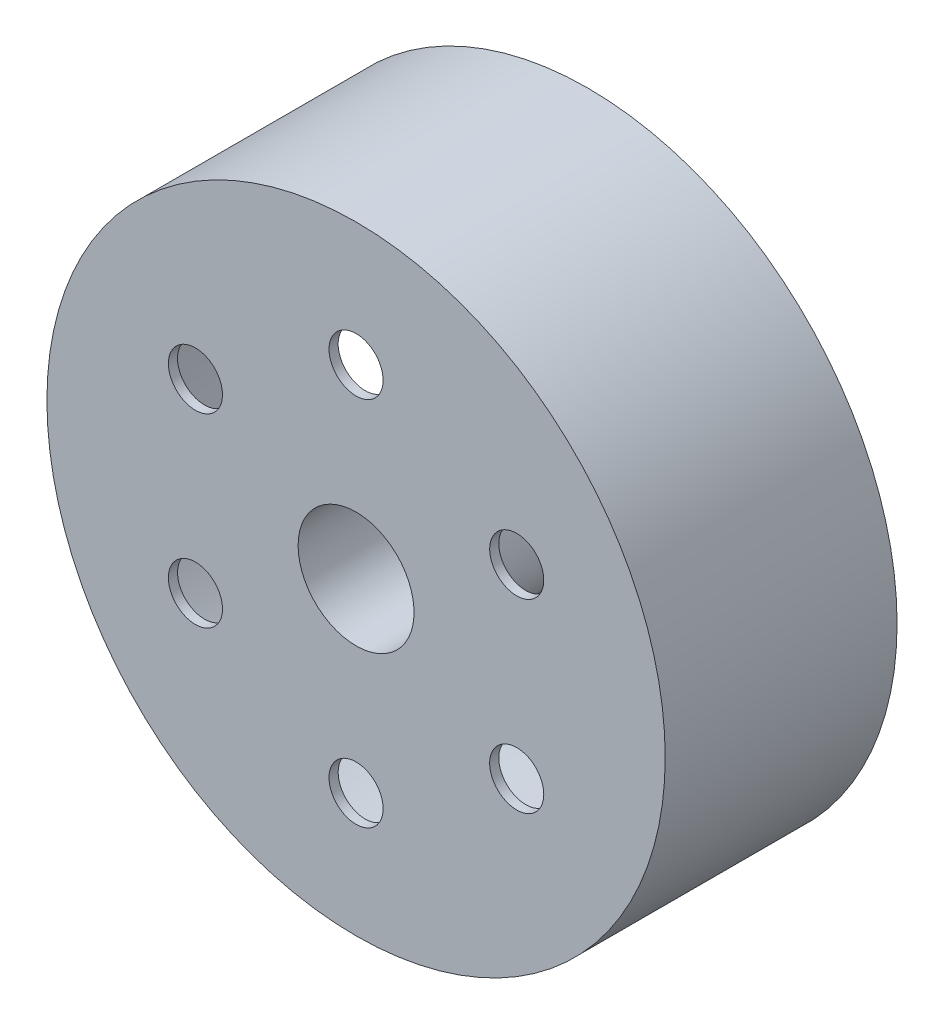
ISO-10303-21;
HEADER;
FILE_DESCRIPTION(('STEP AP214'),'2;1');
FILE_NAME('part.step','',(''),(''),'','','');
FILE_SCHEMA(('AUTOMOTIVE_DESIGN { 1 0 10303 214 1 1 1 1 }'));
ENDSEC;
DATA;
#1=APPLICATION_CONTEXT('core data for automotive mechanical design processes');
#2=APPLICATION_PROTOCOL_DEFINITION('international standard','automotive_design',2000,#1);
#3=PRODUCT_CONTEXT('',#1,'mechanical');
#4=PRODUCT('Part','Part','',(#3));
#5=PRODUCT_RELATED_PRODUCT_CATEGORY('part','',(#4));
#6=PRODUCT_DEFINITION_FORMATION('','',#4);
#7=PRODUCT_DEFINITION_CONTEXT('part definition',#1,'design');
#8=PRODUCT_DEFINITION('design','',#6,#7);
#9=PRODUCT_DEFINITION_SHAPE('','',#8);
#10=(LENGTH_UNIT() NAMED_UNIT(*) SI_UNIT(.MILLI.,.METRE.));
#11=(NAMED_UNIT(*) PLANE_ANGLE_UNIT() SI_UNIT($,.RADIAN.));
#12=(NAMED_UNIT(*) SI_UNIT($,.STERADIAN.) SOLID_ANGLE_UNIT());
#13=UNCERTAINTY_MEASURE_WITH_UNIT(LENGTH_MEASURE(1.E-05),#10,'distance_accuracy_value','');
#14=(GEOMETRIC_REPRESENTATION_CONTEXT(3) GLOBAL_UNCERTAINTY_ASSIGNED_CONTEXT((#13)) GLOBAL_UNIT_ASSIGNED_CONTEXT((#10,
#11,#12)) REPRESENTATION_CONTEXT('',''));
#15=CARTESIAN_POINT('',(0.,0.,0.));
#16=DIRECTION('',(0.,0.,1.));
#17=DIRECTION('',(1.,0.,0.));
#18=AXIS2_PLACEMENT_3D('',#15,#16,#17);
#19=CARTESIAN_POINT('',(0.,0.,0.));
#20=DIRECTION('',(0.,0.,1.));
#21=DIRECTION('',(1.,0.,0.));
#22=AXIS2_PLACEMENT_3D('',#19,#20,#21);
#23=PLANE('',#22);
#24=CARTESIAN_POINT('',(0.,0.,0.));
#25=DIRECTION('',(0.,0.,1.));
#26=DIRECTION('',(1.,0.,0.));
#27=AXIS2_PLACEMENT_3D('',#24,#25,#26);
#28=CIRCLE('',#27,19.05);
#29=CARTESIAN_POINT('',(-19.05,0.,0.));
#30=VERTEX_POINT('',#29);
#31=EDGE_CURVE('E55',#30,#30,#28,.T.);
#32=ORIENTED_EDGE('',*,*,#31,.T.);
#33=EDGE_LOOP('',(#32));
#34=FACE_BOUND('',#33,.T.);
#35=CARTESIAN_POINT('',(0.,0.,0.));
#36=DIRECTION('',(0.,0.,-1.));
#37=DIRECTION('',(-1.,0.,0.));
#38=AXIS2_PLACEMENT_3D('',#35,#36,#37);
#39=CIRCLE('',#38,24.13);
#40=CARTESIAN_POINT('',(-24.13,0.,0.));
#41=VERTEX_POINT('',#40);
#42=EDGE_CURVE('E67',#41,#41,#39,.T.);
#43=ORIENTED_EDGE('',*,*,#42,.T.);
#44=EDGE_LOOP('',(#43));
#45=FACE_BOUND('',#44,.T.);
#46=ADVANCED_FACE('F38',(#34,#45),#23,.F.);
#47=CARTESIAN_POINT('',(0.,0.,76.2));
#48=DIRECTION('',(0.,0.,1.));
#49=DIRECTION('',(1.,0.,0.));
#50=AXIS2_PLACEMENT_3D('',#47,#48,#49);
#51=PLANE('',#50);
#52=CARTESIAN_POINT('',(52.792908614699,30.4800000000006,76.2));
#53=DIRECTION('',(0.,0.,1.));
#54=DIRECTION('',(0.50000000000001,-0.866025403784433,0.));
#55=AXIS2_PLACEMENT_3D('',#52,#53,#54);
#56=CIRCLE('',#55,8.89);
#57=CARTESIAN_POINT('',(57.2379086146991,22.781034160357,76.2));
#58=VERTEX_POINT('',#57);
#59=EDGE_CURVE('E96',#58,#58,#56,.T.);
#60=ORIENTED_EDGE('',*,*,#59,.F.);
#61=EDGE_LOOP('',(#60));
#62=FACE_BOUND('',#61,.T.);
#63=CARTESIAN_POINT('',(52.7929086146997,-30.4799999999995,76.2));
#64=DIRECTION('',(0.,0.,1.));
#65=DIRECTION('',(-0.499999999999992,-0.866025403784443,0.));
#66=AXIS2_PLACEMENT_3D('',#63,#64,#65);
#67=CIRCLE('',#66,8.89);
#68=CARTESIAN_POINT('',(48.3479086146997,-38.1789658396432,76.2));
#69=VERTEX_POINT('',#68);
#70=EDGE_CURVE('E95',#69,#69,#67,.T.);
#71=ORIENTED_EDGE('',*,*,#70,.F.);
#72=EDGE_LOOP('',(#71));
#73=FACE_BOUND('',#72,.T.);
#74=CARTESIAN_POINT('',(0.,-60.96,76.2));
#75=DIRECTION('',(0.,0.,1.));
#76=DIRECTION('',(-1.,0.,0.));
#77=AXIS2_PLACEMENT_3D('',#74,#75,#76);
#78=CIRCLE('',#77,8.89);
#79=CARTESIAN_POINT('',(-8.89,-60.96,76.2));
#80=VERTEX_POINT('',#79);
#81=EDGE_CURVE('E104',#80,#80,#78,.T.);
#82=ORIENTED_EDGE('',*,*,#81,.F.);
#83=EDGE_LOOP('',(#82));
#84=FACE_BOUND('',#83,.T.);
#85=CARTESIAN_POINT('',(-52.7929086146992,-30.4800000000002,76.2));
#86=DIRECTION('',(0.,0.,1.));
#87=DIRECTION('',(-0.500000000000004,0.866025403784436,0.));
#88=AXIS2_PLACEMENT_3D('',#85,#86,#87);
#89=CIRCLE('',#88,8.89);
#90=CARTESIAN_POINT('',(-57.2379086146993,-22.7810341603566,76.2));
#91=VERTEX_POINT('',#90);
#92=EDGE_CURVE('E112',#91,#91,#89,.T.);
#93=ORIENTED_EDGE('',*,*,#92,.F.);
#94=EDGE_LOOP('',(#93));
#95=FACE_BOUND('',#94,.T.);
#96=CARTESIAN_POINT('',(-52.7929086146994,30.4799999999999,76.2));
#97=DIRECTION('',(0.,0.,1.));
#98=DIRECTION('',(0.499999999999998,0.86602540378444,0.));
#99=AXIS2_PLACEMENT_3D('',#96,#97,#98);
#100=CIRCLE('',#99,8.89);
#101=CARTESIAN_POINT('',(-48.3479086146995,38.1789658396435,76.2));
#102=VERTEX_POINT('',#101);
#103=EDGE_CURVE('E86',#102,#102,#100,.T.);
#104=ORIENTED_EDGE('',*,*,#103,.F.);
#105=EDGE_LOOP('',(#104));
#106=FACE_BOUND('',#105,.T.);
#107=CARTESIAN_POINT('',(0.,60.96,76.2));
#108=DIRECTION('',(0.,0.,1.));
#109=DIRECTION('',(1.,0.,0.));
#110=AXIS2_PLACEMENT_3D('',#107,#108,#109);
#111=CIRCLE('',#110,8.89);
#112=CARTESIAN_POINT('',(8.89,60.96,76.2));
#113=VERTEX_POINT('',#112);
#114=EDGE_CURVE('E78',#113,#113,#111,.T.);
#115=ORIENTED_EDGE('',*,*,#114,.F.);
#116=EDGE_LOOP('',(#115));
#117=FACE_BOUND('',#116,.T.);
#118=CARTESIAN_POINT('',(0.,0.,76.2));
#119=DIRECTION('',(0.,0.,1.));
#120=DIRECTION('',(1.,0.,0.));
#121=AXIS2_PLACEMENT_3D('',#118,#119,#120);
#122=CIRCLE('',#121,101.6);
#123=CARTESIAN_POINT('',(-101.6,0.,76.2));
#124=VERTEX_POINT('',#123);
#125=EDGE_CURVE('E11',#124,#124,#122,.T.);
#126=ORIENTED_EDGE('',*,*,#125,.T.);
#127=EDGE_LOOP('',(#126));
#128=FACE_BOUND('',#127,.T.);
#129=CARTESIAN_POINT('',(0.,0.,76.2));
#130=DIRECTION('',(0.,0.,1.));
#131=DIRECTION('',(1.,0.,0.));
#132=AXIS2_PLACEMENT_3D('',#129,#130,#131);
#133=CIRCLE('',#132,19.05);
#134=CARTESIAN_POINT('',(-19.05,0.,76.2));
#135=VERTEX_POINT('',#134);
#136=EDGE_CURVE('E53',#135,#135,#133,.T.);
#137=ORIENTED_EDGE('',*,*,#136,.F.);
#138=EDGE_LOOP('',(#137));
#139=FACE_BOUND('',#138,.T.);
#140=ADVANCED_FACE('F126',(#62,#73,#84,#95,#106,#117,#128,#139),#51,.T.);
#141=CARTESIAN_POINT('',(0.,0.,0.));
#142=DIRECTION('',(0.,0.,-1.));
#143=DIRECTION('',(-1.,0.,0.));
#144=AXIS2_PLACEMENT_3D('',#141,#142,#143);
#145=CIRCLE('',#144,96.52);
#146=CARTESIAN_POINT('',(-96.52,0.,0.));
#147=VERTEX_POINT('',#146);
#148=EDGE_CURVE('E71',#147,#147,#145,.T.);
#149=ORIENTED_EDGE('',*,*,#148,.F.);
#150=EDGE_LOOP('',(#149));
#151=FACE_BOUND('',#150,.T.);
#152=CARTESIAN_POINT('',(0.,0.,0.));
#153=DIRECTION('',(0.,0.,1.));
#154=DIRECTION('',(1.,0.,0.));
#155=AXIS2_PLACEMENT_3D('',#152,#153,#154);
#156=CIRCLE('',#155,101.6);
#157=CARTESIAN_POINT('',(-101.6,0.,0.));
#158=VERTEX_POINT('',#157);
#159=EDGE_CURVE('E47',#158,#158,#156,.T.);
#160=ORIENTED_EDGE('',*,*,#159,.F.);
#161=EDGE_LOOP('',(#160));
#162=FACE_BOUND('',#161,.T.);
#163=ADVANCED_FACE('F129',(#151,#162),#23,.F.);
#164=CARTESIAN_POINT('',(0.,0.,76.2));
#165=DIRECTION('',(0.,0.,-1.));
#166=DIRECTION('',(-1.,0.,0.));
#167=AXIS2_PLACEMENT_3D('',#164,#165,#166);
#168=CYLINDRICAL_SURFACE('',#167,101.6);
#169=CARTESIAN_POINT('',(-101.6,0.,76.2));
#170=CARTESIAN_POINT('',(-101.6,0.,75.40625));
#171=CARTESIAN_POINT('',(-101.6,0.,74.6125));
#172=CARTESIAN_POINT('',(-101.6,0.,73.025));
#173=CARTESIAN_POINT('',(-101.6,0.,72.23125));
#174=CARTESIAN_POINT('',(-101.6,0.,70.64375));
#175=CARTESIAN_POINT('',(-101.6,0.,69.85));
#176=CARTESIAN_POINT('',(-101.6,0.,68.2625));
#177=CARTESIAN_POINT('',(-101.6,0.,67.46875));
#178=CARTESIAN_POINT('',(-101.6,0.,65.88125));
#179=CARTESIAN_POINT('',(-101.6,0.,65.0875));
#180=CARTESIAN_POINT('',(-101.6,0.,63.5));
#181=CARTESIAN_POINT('',(-101.6,0.,62.70625));
#182=CARTESIAN_POINT('',(-101.6,0.,61.11875));
#183=CARTESIAN_POINT('',(-101.6,0.,60.325));
#184=CARTESIAN_POINT('',(-101.6,0.,58.7375));
#185=CARTESIAN_POINT('',(-101.6,0.,57.94375));
#186=CARTESIAN_POINT('',(-101.6,0.,56.35625));
#187=CARTESIAN_POINT('',(-101.6,0.,55.5625));
#188=CARTESIAN_POINT('',(-101.6,0.,53.975));
#189=CARTESIAN_POINT('',(-101.6,0.,53.18125));
#190=CARTESIAN_POINT('',(-101.6,0.,51.59375));
#191=CARTESIAN_POINT('',(-101.6,0.,50.8));
#192=CARTESIAN_POINT('',(-101.6,0.,49.2125));
#193=CARTESIAN_POINT('',(-101.6,0.,48.41875));
#194=CARTESIAN_POINT('',(-101.6,0.,46.83125));
#195=CARTESIAN_POINT('',(-101.6,0.,46.0375));
#196=CARTESIAN_POINT('',(-101.6,0.,44.45));
#197=CARTESIAN_POINT('',(-101.6,0.,43.65625));
#198=CARTESIAN_POINT('',(-101.6,0.,42.06875));
#199=CARTESIAN_POINT('',(-101.6,0.,41.275));
#200=CARTESIAN_POINT('',(-101.6,0.,39.6875));
#201=CARTESIAN_POINT('',(-101.6,0.,38.89375));
#202=CARTESIAN_POINT('',(-101.6,0.,37.30625));
#203=CARTESIAN_POINT('',(-101.6,0.,36.5125));
#204=CARTESIAN_POINT('',(-101.6,0.,34.925));
#205=CARTESIAN_POINT('',(-101.6,0.,34.13125));
#206=CARTESIAN_POINT('',(-101.6,0.,32.54375));
#207=CARTESIAN_POINT('',(-101.6,0.,31.75));
#208=CARTESIAN_POINT('',(-101.6,0.,30.1625));
#209=CARTESIAN_POINT('',(-101.6,0.,29.36875));
#210=CARTESIAN_POINT('',(-101.6,0.,27.78125));
#211=CARTESIAN_POINT('',(-101.6,0.,26.9875));
#212=CARTESIAN_POINT('',(-101.6,0.,25.4));
#213=CARTESIAN_POINT('',(-101.6,0.,24.60625));
#214=CARTESIAN_POINT('',(-101.6,0.,23.01875));
#215=CARTESIAN_POINT('',(-101.6,0.,22.225));
#216=CARTESIAN_POINT('',(-101.6,0.,20.6375));
#217=CARTESIAN_POINT('',(-101.6,0.,19.84375));
#218=CARTESIAN_POINT('',(-101.6,0.,18.25625));
#219=CARTESIAN_POINT('',(-101.6,0.,17.4625));
#220=CARTESIAN_POINT('',(-101.6,0.,15.875));
#221=CARTESIAN_POINT('',(-101.6,0.,15.08125));
#222=CARTESIAN_POINT('',(-101.6,0.,13.49375));
#223=CARTESIAN_POINT('',(-101.6,0.,12.7));
#224=CARTESIAN_POINT('',(-101.6,0.,11.1125));
#225=CARTESIAN_POINT('',(-101.6,0.,10.31875));
#226=CARTESIAN_POINT('',(-101.6,0.,8.73125));
#227=CARTESIAN_POINT('',(-101.6,0.,7.93750000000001));
#228=CARTESIAN_POINT('',(-101.6,0.,6.35));
#229=CARTESIAN_POINT('',(-101.6,0.,5.55625));
#230=CARTESIAN_POINT('',(-101.6,0.,3.96875));
#231=CARTESIAN_POINT('',(-101.6,0.,3.175));
#232=CARTESIAN_POINT('',(-101.6,0.,1.5875));
#233=CARTESIAN_POINT('',(-101.6,0.,0.793750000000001));
#234=CARTESIAN_POINT('',(-101.6,0.,0.));
#235=B_SPLINE_CURVE_WITH_KNOTS('',3,(#169,#170,#171,#172,#173,#174,#175,#176,#177,#178,#179,
#180,#181,#182,#183,#184,#185,#186,#187,#188,#189,#190,#191,#192,#193,#194,#195,#196,#197,#198,
#199,#200,#201,#202,#203,#204,#205,#206,#207,#208,#209,#210,#211,#212,#213,#214,#215,#216,#217,
#218,#219,#220,#221,#222,#223,#224,#225,#226,#227,#228,#229,#230,#231,#232,#233,#234),
.UNSPECIFIED.,.F.,.F.,(4,2,2,2,2,2,2,2,2,2,2,2,2,2,2,2,2,2,2,2,2,2,2,2,2,2,2,2,2,2,2,2,4),(0.,
2.38125,4.7625,7.14375,9.52500000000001,11.90625,14.2875,16.66875,19.05,21.43125,23.8125,
26.19375,28.575,30.95625,33.3375,35.71875,38.1,40.48125,42.8625,45.24375,47.625,50.00625,
52.3875,54.76875,57.15,59.53125,61.9125,64.29375,66.675,69.05625,71.4375,73.81875,76.2),.UNSPECIFIED.);
#236=EDGE_CURVE('BSEAM40',#124,#158,#235,.T.);
#237=ORIENTED_EDGE('',*,*,#125,.F.);
#238=ORIENTED_EDGE('',*,*,#159,.T.);
#239=ORIENTED_EDGE('',*,*,#236,.T.);
#240=ORIENTED_EDGE('',*,*,#236,.F.);
#241=EDGE_LOOP('',(#237,#239,#238,#240));
#242=FACE_BOUND('',#241,.T.);
#243=ADVANCED_FACE('F40',(#242),#168,.T.);
#244=CARTESIAN_POINT('',(0.,0.,76.2));
#245=DIRECTION('',(0.,0.,-1.));
#246=DIRECTION('',(-1.,0.,0.));
#247=AXIS2_PLACEMENT_3D('',#244,#245,#246);
#248=CYLINDRICAL_SURFACE('',#247,19.05);
#249=CARTESIAN_POINT('',(-19.05,0.,76.2));
#250=CARTESIAN_POINT('',(-19.05,0.,75.40625));
#251=CARTESIAN_POINT('',(-19.05,0.,74.6125));
#252=CARTESIAN_POINT('',(-19.05,0.,73.025));
#253=CARTESIAN_POINT('',(-19.05,0.,72.23125));
#254=CARTESIAN_POINT('',(-19.05,0.,70.64375));
#255=CARTESIAN_POINT('',(-19.05,0.,69.85));
#256=CARTESIAN_POINT('',(-19.05,0.,68.2625));
#257=CARTESIAN_POINT('',(-19.05,0.,67.46875));
#258=CARTESIAN_POINT('',(-19.05,0.,65.88125));
#259=CARTESIAN_POINT('',(-19.05,0.,65.0875));
#260=CARTESIAN_POINT('',(-19.05,0.,63.5));
#261=CARTESIAN_POINT('',(-19.05,0.,62.70625));
#262=CARTESIAN_POINT('',(-19.05,0.,61.11875));
#263=CARTESIAN_POINT('',(-19.05,0.,60.325));
#264=CARTESIAN_POINT('',(-19.05,0.,58.7375));
#265=CARTESIAN_POINT('',(-19.05,0.,57.94375));
#266=CARTESIAN_POINT('',(-19.05,0.,56.35625));
#267=CARTESIAN_POINT('',(-19.05,0.,55.5625));
#268=CARTESIAN_POINT('',(-19.05,0.,53.975));
#269=CARTESIAN_POINT('',(-19.05,0.,53.18125));
#270=CARTESIAN_POINT('',(-19.05,0.,51.59375));
#271=CARTESIAN_POINT('',(-19.05,0.,50.8));
#272=CARTESIAN_POINT('',(-19.05,0.,49.2125));
#273=CARTESIAN_POINT('',(-19.05,0.,48.41875));
#274=CARTESIAN_POINT('',(-19.05,0.,46.83125));
#275=CARTESIAN_POINT('',(-19.05,0.,46.0375));
#276=CARTESIAN_POINT('',(-19.05,0.,44.45));
#277=CARTESIAN_POINT('',(-19.05,0.,43.65625));
#278=CARTESIAN_POINT('',(-19.05,0.,42.06875));
#279=CARTESIAN_POINT('',(-19.05,0.,41.275));
#280=CARTESIAN_POINT('',(-19.05,0.,39.6875));
#281=CARTESIAN_POINT('',(-19.05,0.,38.89375));
#282=CARTESIAN_POINT('',(-19.05,0.,37.30625));
#283=CARTESIAN_POINT('',(-19.05,0.,36.5125));
#284=CARTESIAN_POINT('',(-19.05,0.,34.925));
#285=CARTESIAN_POINT('',(-19.05,0.,34.13125));
#286=CARTESIAN_POINT('',(-19.05,0.,32.54375));
#287=CARTESIAN_POINT('',(-19.05,0.,31.75));
#288=CARTESIAN_POINT('',(-19.05,0.,30.1625));
#289=CARTESIAN_POINT('',(-19.05,0.,29.36875));
#290=CARTESIAN_POINT('',(-19.05,0.,27.78125));
#291=CARTESIAN_POINT('',(-19.05,0.,26.9875));
#292=CARTESIAN_POINT('',(-19.05,0.,25.4));
#293=CARTESIAN_POINT('',(-19.05,0.,24.60625));
#294=CARTESIAN_POINT('',(-19.05,0.,23.01875));
#295=CARTESIAN_POINT('',(-19.05,0.,22.225));
#296=CARTESIAN_POINT('',(-19.05,0.,20.6375));
#297=CARTESIAN_POINT('',(-19.05,0.,19.84375));
#298=CARTESIAN_POINT('',(-19.05,0.,18.25625));
#299=CARTESIAN_POINT('',(-19.05,0.,17.4625));
#300=CARTESIAN_POINT('',(-19.05,0.,15.875));
#301=CARTESIAN_POINT('',(-19.05,0.,15.08125));
#302=CARTESIAN_POINT('',(-19.05,0.,13.49375));
#303=CARTESIAN_POINT('',(-19.05,0.,12.7));
#304=CARTESIAN_POINT('',(-19.05,0.,11.1125));
#305=CARTESIAN_POINT('',(-19.05,0.,10.31875));
#306=CARTESIAN_POINT('',(-19.05,0.,8.73125));
#307=CARTESIAN_POINT('',(-19.05,0.,7.93750000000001));
#308=CARTESIAN_POINT('',(-19.05,0.,6.35));
#309=CARTESIAN_POINT('',(-19.05,0.,5.55625));
#310=CARTESIAN_POINT('',(-19.05,0.,3.96875));
#311=CARTESIAN_POINT('',(-19.05,0.,3.175));
#312=CARTESIAN_POINT('',(-19.05,0.,1.5875));
#313=CARTESIAN_POINT('',(-19.05,0.,0.793750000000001));
#314=CARTESIAN_POINT('',(-19.05,0.,0.));
#315=B_SPLINE_CURVE_WITH_KNOTS('',3,(#249,#250,#251,#252,#253,#254,#255,#256,#257,#258,#259,
#260,#261,#262,#263,#264,#265,#266,#267,#268,#269,#270,#271,#272,#273,#274,#275,#276,#277,#278,
#279,#280,#281,#282,#283,#284,#285,#286,#287,#288,#289,#290,#291,#292,#293,#294,#295,#296,#297,
#298,#299,#300,#301,#302,#303,#304,#305,#306,#307,#308,#309,#310,#311,#312,#313,#314),
.UNSPECIFIED.,.F.,.F.,(4,2,2,2,2,2,2,2,2,2,2,2,2,2,2,2,2,2,2,2,2,2,2,2,2,2,2,2,2,2,2,2,4),(0.,
2.38125,4.7625,7.14375,9.52500000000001,11.90625,14.2875,16.66875,19.05,21.43125,23.8125,
26.19375,28.575,30.95625,33.3375,35.71875,38.1,40.48125,42.8625,45.24375,47.625,50.00625,
52.3875,54.76875,57.15,59.53125,61.9125,64.29375,66.675,69.05625,71.4375,73.81875,76.2),.UNSPECIFIED.);
#316=EDGE_CURVE('BSEAM138',#135,#30,#315,.T.);
#317=ORIENTED_EDGE('',*,*,#136,.T.);
#318=ORIENTED_EDGE('',*,*,#31,.F.);
#319=ORIENTED_EDGE('',*,*,#316,.T.);
#320=ORIENTED_EDGE('',*,*,#316,.F.);
#321=EDGE_LOOP('',(#317,#319,#318,#320));
#322=FACE_BOUND('',#321,.T.);
#323=ADVANCED_FACE('F138',(#322),#248,.F.);
#324=CARTESIAN_POINT('',(0.,0.,349.199786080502));
#325=DIRECTION('',(0.,0.,-1.));
#326=DIRECTION('',(-1.,0.,0.));
#327=AXIS2_PLACEMENT_3D('',#324,#325,#326);
#328=CYLINDRICAL_SURFACE('',#327,96.52);
#329=CARTESIAN_POINT('',(0.,0.,73.2));
#330=DIRECTION('',(0.,0.,1.));
#331=DIRECTION('',(1.,0.,0.));
#332=AXIS2_PLACEMENT_3D('',#329,#330,#331);
#333=CIRCLE('',#332,96.52);
#334=CARTESIAN_POINT('',(-96.52,0.,73.1999999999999));
#335=VERTEX_POINT('',#334);
#336=EDGE_CURVE('E63',#335,#335,#333,.F.);
#337=CARTESIAN_POINT('',(-96.52,0.,0.));
#338=CARTESIAN_POINT('',(-96.52,0.,0.762499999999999));
#339=CARTESIAN_POINT('',(-96.52,0.,1.525));
#340=CARTESIAN_POINT('',(-96.52,0.,3.05));
#341=CARTESIAN_POINT('',(-96.52,0.,3.8125));
#342=CARTESIAN_POINT('',(-96.52,0.,5.3375));
#343=CARTESIAN_POINT('',(-96.52,0.,6.09999999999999));
#344=CARTESIAN_POINT('',(-96.52,0.,7.62499999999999));
#345=CARTESIAN_POINT('',(-96.52,0.,8.38749999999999));
#346=CARTESIAN_POINT('',(-96.52,0.,9.91249999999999));
#347=CARTESIAN_POINT('',(-96.52,0.,10.675));
#348=CARTESIAN_POINT('',(-96.52,0.,12.2));
#349=CARTESIAN_POINT('',(-96.52,0.,12.9625));
#350=CARTESIAN_POINT('',(-96.52,0.,14.4875));
#351=CARTESIAN_POINT('',(-96.52,0.,15.25));
#352=CARTESIAN_POINT('',(-96.52,0.,16.775));
#353=CARTESIAN_POINT('',(-96.52,0.,17.5375));
#354=CARTESIAN_POINT('',(-96.52,0.,19.0625));
#355=CARTESIAN_POINT('',(-96.52,0.,19.825));
#356=CARTESIAN_POINT('',(-96.52,0.,21.35));
#357=CARTESIAN_POINT('',(-96.52,0.,22.1125));
#358=CARTESIAN_POINT('',(-96.52,0.,23.6375));
#359=CARTESIAN_POINT('',(-96.52,0.,24.4));
#360=CARTESIAN_POINT('',(-96.52,0.,25.925));
#361=CARTESIAN_POINT('',(-96.52,0.,26.6875));
#362=CARTESIAN_POINT('',(-96.52,0.,28.2125));
#363=CARTESIAN_POINT('',(-96.52,0.,28.975));
#364=CARTESIAN_POINT('',(-96.52,0.,30.5));
#365=CARTESIAN_POINT('',(-96.52,0.,31.2625));
#366=CARTESIAN_POINT('',(-96.52,0.,32.7875));
#367=CARTESIAN_POINT('',(-96.52,0.,33.55));
#368=CARTESIAN_POINT('',(-96.52,0.,35.075));
#369=CARTESIAN_POINT('',(-96.52,0.,35.8375));
#370=CARTESIAN_POINT('',(-96.52,0.,37.3625));
#371=CARTESIAN_POINT('',(-96.52,0.,38.125));
#372=CARTESIAN_POINT('',(-96.52,0.,39.65));
#373=CARTESIAN_POINT('',(-96.52,0.,40.4125));
#374=CARTESIAN_POINT('',(-96.52,0.,41.9375));
#375=CARTESIAN_POINT('',(-96.52,0.,42.7));
#376=CARTESIAN_POINT('',(-96.52,0.,44.225));
#377=CARTESIAN_POINT('',(-96.52,0.,44.9875));
#378=CARTESIAN_POINT('',(-96.52,0.,46.5125));
#379=CARTESIAN_POINT('',(-96.52,0.,47.275));
#380=CARTESIAN_POINT('',(-96.52,0.,48.8));
#381=CARTESIAN_POINT('',(-96.52,0.,49.5625));
#382=CARTESIAN_POINT('',(-96.52,0.,51.0874999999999));
#383=CARTESIAN_POINT('',(-96.52,0.,51.85));
#384=CARTESIAN_POINT('',(-96.52,0.,53.375));
#385=CARTESIAN_POINT('',(-96.52,0.,54.1374999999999));
#386=CARTESIAN_POINT('',(-96.52,0.,55.6625));
#387=CARTESIAN_POINT('',(-96.52,0.,56.4249999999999));
#388=CARTESIAN_POINT('',(-96.52,0.,57.9499999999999));
#389=CARTESIAN_POINT('',(-96.52,0.,58.7124999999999));
#390=CARTESIAN_POINT('',(-96.52,0.,60.2374999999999));
#391=CARTESIAN_POINT('',(-96.52,0.,60.9999999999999));
#392=CARTESIAN_POINT('',(-96.52,0.,62.5249999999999));
#393=CARTESIAN_POINT('',(-96.52,0.,63.2874999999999));
#394=CARTESIAN_POINT('',(-96.52,0.,64.8124999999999));
#395=CARTESIAN_POINT('',(-96.52,0.,65.5749999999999));
#396=CARTESIAN_POINT('',(-96.52,0.,67.0999999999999));
#397=CARTESIAN_POINT('',(-96.52,0.,67.8624999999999));
#398=CARTESIAN_POINT('',(-96.52,0.,69.3874999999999));
#399=CARTESIAN_POINT('',(-96.52,0.,70.1499999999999));
#400=CARTESIAN_POINT('',(-96.52,0.,71.6749999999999));
#401=CARTESIAN_POINT('',(-96.52,0.,72.4374999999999));
#402=CARTESIAN_POINT('',(-96.52,0.,73.1999999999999));
#403=B_SPLINE_CURVE_WITH_KNOTS('',3,(#337,#338,#339,#340,#341,#342,#343,#344,#345,#346,#347,
#348,#349,#350,#351,#352,#353,#354,#355,#356,#357,#358,#359,#360,#361,#362,#363,#364,#365,#366,
#367,#368,#369,#370,#371,#372,#373,#374,#375,#376,#377,#378,#379,#380,#381,#382,#383,#384,#385,
#386,#387,#388,#389,#390,#391,#392,#393,#394,#395,#396,#397,#398,#399,#400,#401,#402),
.UNSPECIFIED.,.F.,.F.,(4,2,2,2,2,2,2,2,2,2,2,2,2,2,2,2,2,2,2,2,2,2,2,2,2,2,2,2,2,2,2,2,4),(0.,
2.2875,4.575,6.86249999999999,9.14999999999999,11.4375,13.725,16.0125,18.3,20.5875,22.875,
25.1625,27.45,29.7375,32.025,34.3125,36.6,38.8875,41.175,43.4625,45.75,48.0375,50.325,52.6125,
54.8999999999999,57.1874999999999,59.4749999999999,61.7624999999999,64.0499999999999,
66.3374999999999,68.6249999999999,70.9124999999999,73.1999999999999),.UNSPECIFIED.);
#404=EDGE_CURVE('BSEAM141',#147,#335,#403,.T.);
#405=ORIENTED_EDGE('',*,*,#148,.T.);
#406=ORIENTED_EDGE('',*,*,#336,.F.);
#407=ORIENTED_EDGE('',*,*,#404,.T.);
#408=ORIENTED_EDGE('',*,*,#404,.F.);
#409=EDGE_LOOP('',(#405,#407,#406,#408));
#410=FACE_BOUND('',#409,.T.);
#411=ADVANCED_FACE('F141',(#410),#328,.F.);
#412=CARTESIAN_POINT('',(0.,0.,349.199786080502));
#413=DIRECTION('',(0.,0.,-1.));
#414=DIRECTION('',(-1.,0.,0.));
#415=AXIS2_PLACEMENT_3D('',#412,#413,#414);
#416=CYLINDRICAL_SURFACE('',#415,24.13);
#417=CARTESIAN_POINT('',(0.,0.,73.2));
#418=DIRECTION('',(0.,0.,1.));
#419=DIRECTION('',(1.,0.,0.));
#420=AXIS2_PLACEMENT_3D('',#417,#418,#419);
#421=CIRCLE('',#420,24.13);
#422=CARTESIAN_POINT('',(-24.13,0.,73.1999999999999));
#423=VERTEX_POINT('',#422);
#424=EDGE_CURVE('E59',#423,#423,#421,.F.);
#425=CARTESIAN_POINT('',(-24.13,0.,0.));
#426=CARTESIAN_POINT('',(-24.13,0.,0.762499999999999));
#427=CARTESIAN_POINT('',(-24.13,0.,1.525));
#428=CARTESIAN_POINT('',(-24.13,0.,3.05));
#429=CARTESIAN_POINT('',(-24.13,0.,3.8125));
#430=CARTESIAN_POINT('',(-24.13,0.,5.3375));
#431=CARTESIAN_POINT('',(-24.13,0.,6.09999999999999));
#432=CARTESIAN_POINT('',(-24.13,0.,7.62499999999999));
#433=CARTESIAN_POINT('',(-24.13,0.,8.38749999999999));
#434=CARTESIAN_POINT('',(-24.13,0.,9.91249999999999));
#435=CARTESIAN_POINT('',(-24.13,0.,10.675));
#436=CARTESIAN_POINT('',(-24.13,0.,12.2));
#437=CARTESIAN_POINT('',(-24.13,0.,12.9625));
#438=CARTESIAN_POINT('',(-24.13,0.,14.4875));
#439=CARTESIAN_POINT('',(-24.13,0.,15.25));
#440=CARTESIAN_POINT('',(-24.13,0.,16.775));
#441=CARTESIAN_POINT('',(-24.13,0.,17.5375));
#442=CARTESIAN_POINT('',(-24.13,0.,19.0625));
#443=CARTESIAN_POINT('',(-24.13,0.,19.825));
#444=CARTESIAN_POINT('',(-24.13,0.,21.35));
#445=CARTESIAN_POINT('',(-24.13,0.,22.1125));
#446=CARTESIAN_POINT('',(-24.13,0.,23.6375));
#447=CARTESIAN_POINT('',(-24.13,0.,24.4));
#448=CARTESIAN_POINT('',(-24.13,0.,25.925));
#449=CARTESIAN_POINT('',(-24.13,0.,26.6875));
#450=CARTESIAN_POINT('',(-24.13,0.,28.2125));
#451=CARTESIAN_POINT('',(-24.13,0.,28.975));
#452=CARTESIAN_POINT('',(-24.13,0.,30.5));
#453=CARTESIAN_POINT('',(-24.13,0.,31.2625));
#454=CARTESIAN_POINT('',(-24.13,0.,32.7875));
#455=CARTESIAN_POINT('',(-24.13,0.,33.55));
#456=CARTESIAN_POINT('',(-24.13,0.,35.075));
#457=CARTESIAN_POINT('',(-24.13,0.,35.8375));
#458=CARTESIAN_POINT('',(-24.13,0.,37.3625));
#459=CARTESIAN_POINT('',(-24.13,0.,38.125));
#460=CARTESIAN_POINT('',(-24.13,0.,39.65));
#461=CARTESIAN_POINT('',(-24.13,0.,40.4125));
#462=CARTESIAN_POINT('',(-24.13,0.,41.9375));
#463=CARTESIAN_POINT('',(-24.13,0.,42.7));
#464=CARTESIAN_POINT('',(-24.13,0.,44.225));
#465=CARTESIAN_POINT('',(-24.13,0.,44.9875));
#466=CARTESIAN_POINT('',(-24.13,0.,46.5125));
#467=CARTESIAN_POINT('',(-24.13,0.,47.275));
#468=CARTESIAN_POINT('',(-24.13,0.,48.8));
#469=CARTESIAN_POINT('',(-24.13,0.,49.5625));
#470=CARTESIAN_POINT('',(-24.13,0.,51.0874999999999));
#471=CARTESIAN_POINT('',(-24.13,0.,51.85));
#472=CARTESIAN_POINT('',(-24.13,0.,53.375));
#473=CARTESIAN_POINT('',(-24.13,0.,54.1374999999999));
#474=CARTESIAN_POINT('',(-24.13,0.,55.6625));
#475=CARTESIAN_POINT('',(-24.13,0.,56.4249999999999));
#476=CARTESIAN_POINT('',(-24.13,0.,57.9499999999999));
#477=CARTESIAN_POINT('',(-24.13,0.,58.7124999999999));
#478=CARTESIAN_POINT('',(-24.13,0.,60.2374999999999));
#479=CARTESIAN_POINT('',(-24.13,0.,60.9999999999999));
#480=CARTESIAN_POINT('',(-24.13,0.,62.5249999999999));
#481=CARTESIAN_POINT('',(-24.13,0.,63.2874999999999));
#482=CARTESIAN_POINT('',(-24.13,0.,64.8124999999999));
#483=CARTESIAN_POINT('',(-24.13,0.,65.5749999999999));
#484=CARTESIAN_POINT('',(-24.13,0.,67.0999999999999));
#485=CARTESIAN_POINT('',(-24.13,0.,67.8624999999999));
#486=CARTESIAN_POINT('',(-24.13,0.,69.3874999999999));
#487=CARTESIAN_POINT('',(-24.13,0.,70.1499999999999));
#488=CARTESIAN_POINT('',(-24.13,0.,71.6749999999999));
#489=CARTESIAN_POINT('',(-24.13,0.,72.4374999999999));
#490=CARTESIAN_POINT('',(-24.13,0.,73.1999999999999));
#491=B_SPLINE_CURVE_WITH_KNOTS('',3,(#425,#426,#427,#428,#429,#430,#431,#432,#433,#434,#435,
#436,#437,#438,#439,#440,#441,#442,#443,#444,#445,#446,#447,#448,#449,#450,#451,#452,#453,#454,
#455,#456,#457,#458,#459,#460,#461,#462,#463,#464,#465,#466,#467,#468,#469,#470,#471,#472,#473,
#474,#475,#476,#477,#478,#479,#480,#481,#482,#483,#484,#485,#486,#487,#488,#489,#490),
.UNSPECIFIED.,.F.,.F.,(4,2,2,2,2,2,2,2,2,2,2,2,2,2,2,2,2,2,2,2,2,2,2,2,2,2,2,2,2,2,2,2,4),(0.,
2.2875,4.575,6.86249999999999,9.14999999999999,11.4375,13.725,16.0125,18.3,20.5875,22.875,
25.1625,27.45,29.7375,32.025,34.3125,36.6,38.8875,41.175,43.4625,45.75,48.0375,50.325,52.6125,
54.8999999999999,57.1874999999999,59.4749999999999,61.7624999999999,64.0499999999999,
66.3374999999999,68.6249999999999,70.9124999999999,73.1999999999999),.UNSPECIFIED.);
#492=EDGE_CURVE('BSEAM149',#41,#423,#491,.T.);
#493=ORIENTED_EDGE('',*,*,#42,.F.);
#494=ORIENTED_EDGE('',*,*,#424,.T.);
#495=ORIENTED_EDGE('',*,*,#492,.T.);
#496=ORIENTED_EDGE('',*,*,#492,.F.);
#497=EDGE_LOOP('',(#493,#495,#494,#496));
#498=FACE_BOUND('',#497,.T.);
#499=ADVANCED_FACE('F149',(#498),#416,.T.);
#500=CARTESIAN_POINT('',(0.,0.,73.2));
#501=DIRECTION('',(0.,0.,1.));
#502=DIRECTION('',(1.,0.,0.));
#503=AXIS2_PLACEMENT_3D('',#500,#501,#502);
#504=PLANE('',#503);
#505=CARTESIAN_POINT('',(52.792908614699,30.4800000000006,73.2));
#506=DIRECTION('',(0.,0.,1.));
#507=DIRECTION('',(0.50000000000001,-0.866025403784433,0.));
#508=AXIS2_PLACEMENT_3D('',#505,#506,#507);
#509=CIRCLE('',#508,8.89);
#510=CARTESIAN_POINT('',(57.2379086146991,22.781034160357,73.2));
#511=VERTEX_POINT('',#510);
#512=EDGE_CURVE('E91',#511,#511,#509,.T.);
#513=ORIENTED_EDGE('',*,*,#512,.T.);
#514=EDGE_LOOP('',(#513));
#515=FACE_BOUND('',#514,.T.);
#516=CARTESIAN_POINT('',(52.7929086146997,-30.4799999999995,73.2));
#517=DIRECTION('',(0.,0.,1.));
#518=DIRECTION('',(-0.499999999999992,-0.866025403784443,0.));
#519=AXIS2_PLACEMENT_3D('',#516,#517,#518);
#520=CIRCLE('',#519,8.89);
#521=CARTESIAN_POINT('',(48.3479086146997,-38.1789658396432,73.2));
#522=VERTEX_POINT('',#521);
#523=EDGE_CURVE('E100',#522,#522,#520,.T.);
#524=ORIENTED_EDGE('',*,*,#523,.T.);
#525=EDGE_LOOP('',(#524));
#526=FACE_BOUND('',#525,.T.);
#527=CARTESIAN_POINT('',(0.,-60.96,73.2));
#528=DIRECTION('',(0.,0.,1.));
#529=DIRECTION('',(-1.,0.,0.));
#530=AXIS2_PLACEMENT_3D('',#527,#528,#529);
#531=CIRCLE('',#530,8.89);
#532=CARTESIAN_POINT('',(-8.89,-60.96,73.2));
#533=VERTEX_POINT('',#532);
#534=EDGE_CURVE('E108',#533,#533,#531,.T.);
#535=ORIENTED_EDGE('',*,*,#534,.T.);
#536=EDGE_LOOP('',(#535));
#537=FACE_BOUND('',#536,.T.);
#538=CARTESIAN_POINT('',(-52.7929086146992,-30.4800000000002,73.2));
#539=DIRECTION('',(0.,0.,1.));
#540=DIRECTION('',(-0.500000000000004,0.866025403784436,0.));
#541=AXIS2_PLACEMENT_3D('',#538,#539,#540);
#542=CIRCLE('',#541,8.89);
#543=CARTESIAN_POINT('',(-57.2379086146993,-22.7810341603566,73.2));
#544=VERTEX_POINT('',#543);
#545=EDGE_CURVE('E90',#544,#544,#542,.T.);
#546=ORIENTED_EDGE('',*,*,#545,.T.);
#547=EDGE_LOOP('',(#546));
#548=FACE_BOUND('',#547,.T.);
#549=CARTESIAN_POINT('',(-52.7929086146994,30.4799999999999,73.2));
#550=DIRECTION('',(0.,0.,1.));
#551=DIRECTION('',(0.499999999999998,0.86602540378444,0.));
#552=AXIS2_PLACEMENT_3D('',#549,#550,#551);
#553=CIRCLE('',#552,8.89);
#554=CARTESIAN_POINT('',(-48.3479086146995,38.1789658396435,73.2));
#555=VERTEX_POINT('',#554);
#556=EDGE_CURVE('E82',#555,#555,#553,.T.);
#557=ORIENTED_EDGE('',*,*,#556,.T.);
#558=EDGE_LOOP('',(#557));
#559=FACE_BOUND('',#558,.T.);
#560=CARTESIAN_POINT('',(0.,60.96,73.2));
#561=DIRECTION('',(0.,0.,1.));
#562=DIRECTION('',(1.,0.,0.));
#563=AXIS2_PLACEMENT_3D('',#560,#561,#562);
#564=CIRCLE('',#563,8.89);
#565=CARTESIAN_POINT('',(8.89,60.96,73.2));
#566=VERTEX_POINT('',#565);
#567=EDGE_CURVE('E42',#566,#566,#564,.T.);
#568=ORIENTED_EDGE('',*,*,#567,.T.);
#569=EDGE_LOOP('',(#568));
#570=FACE_BOUND('',#569,.T.);
#571=ORIENTED_EDGE('',*,*,#336,.T.);
#572=EDGE_LOOP('',(#571));
#573=FACE_BOUND('',#572,.T.);
#574=ORIENTED_EDGE('',*,*,#424,.F.);
#575=EDGE_LOOP('',(#574));
#576=FACE_BOUND('',#575,.T.);
#577=ADVANCED_FACE('F152',(#515,#526,#537,#548,#559,#570,#573,#576),#504,.F.);
#578=CARTESIAN_POINT('',(0.,60.96,55.372));
#579=DIRECTION('',(0.,0.,1.));
#580=DIRECTION('',(1.,0.,0.));
#581=AXIS2_PLACEMENT_3D('',#578,#579,#580);
#582=CYLINDRICAL_SURFACE('',#581,8.89);
#583=ORIENTED_EDGE('',*,*,#114,.T.);
#584=EDGE_LOOP('',(#583));
#585=FACE_BOUND('',#584,.T.);
#586=ORIENTED_EDGE('',*,*,#567,.F.);
#587=EDGE_LOOP('',(#586));
#588=FACE_BOUND('',#587,.T.);
#589=ADVANCED_FACE('F157',(#585,#588),#582,.F.);
#590=CARTESIAN_POINT('',(-52.7929086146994,30.4799999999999,55.372));
#591=DIRECTION('',(0.,0.,1.));
#592=DIRECTION('',(0.499999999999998,0.86602540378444,0.));
#593=AXIS2_PLACEMENT_3D('',#590,#591,#592);
#594=CYLINDRICAL_SURFACE('',#593,8.89);
#595=ORIENTED_EDGE('',*,*,#103,.T.);
#596=EDGE_LOOP('',(#595));
#597=FACE_BOUND('',#596,.T.);
#598=ORIENTED_EDGE('',*,*,#556,.F.);
#599=EDGE_LOOP('',(#598));
#600=FACE_BOUND('',#599,.T.);
#601=ADVANCED_FACE('F164',(#597,#600),#594,.F.);
#602=CARTESIAN_POINT('',(-52.7929086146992,-30.4800000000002,55.372));
#603=DIRECTION('',(0.,0.,1.));
#604=DIRECTION('',(-0.500000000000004,0.866025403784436,0.));
#605=AXIS2_PLACEMENT_3D('',#602,#603,#604);
#606=CYLINDRICAL_SURFACE('',#605,8.89);
#607=ORIENTED_EDGE('',*,*,#92,.T.);
#608=EDGE_LOOP('',(#607));
#609=FACE_BOUND('',#608,.T.);
#610=ORIENTED_EDGE('',*,*,#545,.F.);
#611=EDGE_LOOP('',(#610));
#612=FACE_BOUND('',#611,.T.);
#613=ADVANCED_FACE('F123',(#609,#612),#606,.F.);
#614=CARTESIAN_POINT('',(0.,-60.96,55.372));
#615=DIRECTION('',(0.,0.,1.));
#616=DIRECTION('',(-1.,0.,0.));
#617=AXIS2_PLACEMENT_3D('',#614,#615,#616);
#618=CYLINDRICAL_SURFACE('',#617,8.89);
#619=ORIENTED_EDGE('',*,*,#81,.T.);
#620=EDGE_LOOP('',(#619));
#621=FACE_BOUND('',#620,.T.);
#622=ORIENTED_EDGE('',*,*,#534,.F.);
#623=EDGE_LOOP('',(#622));
#624=FACE_BOUND('',#623,.T.);
#625=ADVANCED_FACE('F198',(#621,#624),#618,.F.);
#626=CARTESIAN_POINT('',(52.7929086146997,-30.4799999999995,55.372));
#627=DIRECTION('',(0.,0.,1.));
#628=DIRECTION('',(-0.499999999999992,-0.866025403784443,0.));
#629=AXIS2_PLACEMENT_3D('',#626,#627,#628);
#630=CYLINDRICAL_SURFACE('',#629,8.89);
#631=ORIENTED_EDGE('',*,*,#70,.T.);
#632=EDGE_LOOP('',(#631));
#633=FACE_BOUND('',#632,.T.);
#634=ORIENTED_EDGE('',*,*,#523,.F.);
#635=EDGE_LOOP('',(#634));
#636=FACE_BOUND('',#635,.T.);
#637=ADVANCED_FACE('F194',(#633,#636),#630,.F.);
#638=CARTESIAN_POINT('',(52.792908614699,30.4800000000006,55.372));
#639=DIRECTION('',(0.,0.,1.));
#640=DIRECTION('',(0.50000000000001,-0.866025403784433,0.));
#641=AXIS2_PLACEMENT_3D('',#638,#639,#640);
#642=CYLINDRICAL_SURFACE('',#641,8.89);
#643=ORIENTED_EDGE('',*,*,#59,.T.);
#644=EDGE_LOOP('',(#643));
#645=FACE_BOUND('',#644,.T.);
#646=ORIENTED_EDGE('',*,*,#512,.F.);
#647=EDGE_LOOP('',(#646));
#648=FACE_BOUND('',#647,.T.);
#649=ADVANCED_FACE('F191',(#645,#648),#642,.F.);
#650=CLOSED_SHELL('',(#46,#140,#163,#243,#323,#411,#499,#577,#589,#601,#613,#625,#637,#649));
#651=MANIFOLD_SOLID_BREP('B2',#650);
#652=ADVANCED_BREP_SHAPE_REPRESENTATION('',(#18,#651),#14);
#653=SHAPE_DEFINITION_REPRESENTATION(#9,#652);
ENDSEC;
END-ISO-10303-21;
